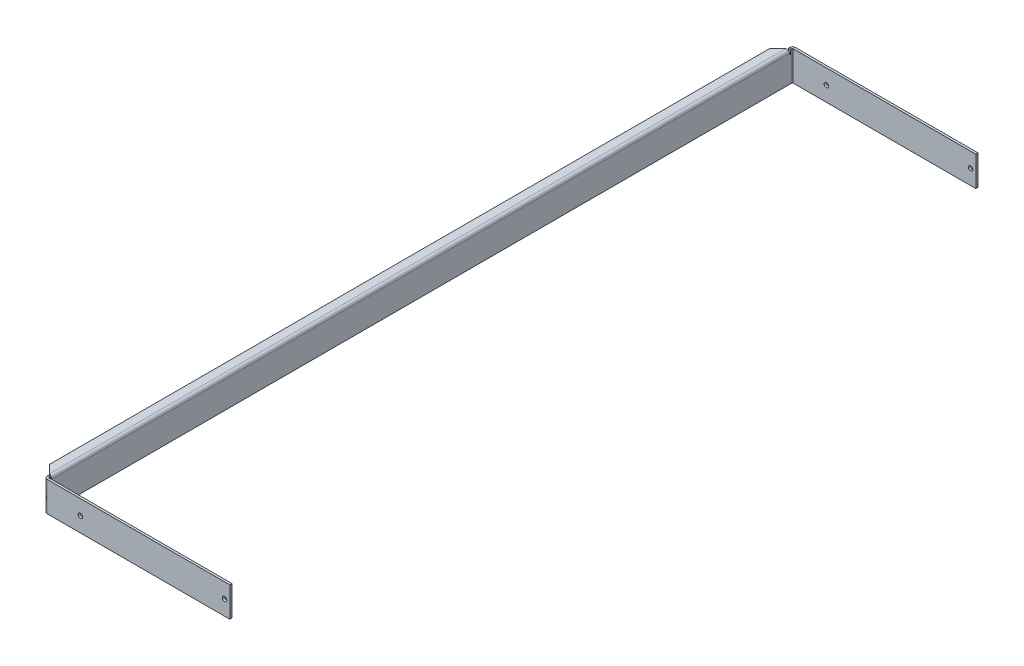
ISO-10303-21;
HEADER;
FILE_DESCRIPTION(('STEP AP214'),'2;1');
FILE_NAME('part.step','',(''),(''),'','','');
FILE_SCHEMA(('AUTOMOTIVE_DESIGN { 1 0 10303 214 1 1 1 1 }'));
ENDSEC;
DATA;
#1=APPLICATION_CONTEXT('core data for automotive mechanical design processes');
#2=APPLICATION_PROTOCOL_DEFINITION('international standard','automotive_design',2000,#1);
#3=PRODUCT_CONTEXT('',#1,'mechanical');
#4=PRODUCT('Part','Part','',(#3));
#5=PRODUCT_RELATED_PRODUCT_CATEGORY('part','',(#4));
#6=PRODUCT_DEFINITION_FORMATION('','',#4);
#7=PRODUCT_DEFINITION_CONTEXT('part definition',#1,'design');
#8=PRODUCT_DEFINITION('design','',#6,#7);
#9=PRODUCT_DEFINITION_SHAPE('','',#8);
#10=(LENGTH_UNIT() NAMED_UNIT(*) SI_UNIT(.MILLI.,.METRE.));
#11=(NAMED_UNIT(*) PLANE_ANGLE_UNIT() SI_UNIT($,.RADIAN.));
#12=(NAMED_UNIT(*) SI_UNIT($,.STERADIAN.) SOLID_ANGLE_UNIT());
#13=UNCERTAINTY_MEASURE_WITH_UNIT(LENGTH_MEASURE(1.E-05),#10,'distance_accuracy_value','');
#14=(GEOMETRIC_REPRESENTATION_CONTEXT(3) GLOBAL_UNCERTAINTY_ASSIGNED_CONTEXT((#13)) GLOBAL_UNIT_ASSIGNED_CONTEXT((#10,
#11,#12)) REPRESENTATION_CONTEXT('',''));
#15=CARTESIAN_POINT('',(0.,0.,0.));
#16=DIRECTION('',(0.,0.,1.));
#17=DIRECTION('',(1.,0.,0.));
#18=AXIS2_PLACEMENT_3D('',#15,#16,#17);
#19=CARTESIAN_POINT('',(239.,20.,-502.));
#20=DIRECTION('',(0.,0.,1.));
#21=DIRECTION('',(1.,0.,0.));
#22=AXIS2_PLACEMENT_3D('',#19,#20,#21);
#23=CYLINDRICAL_SURFACE('',#22,2.99999999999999);
#24=CARTESIAN_POINT('',(239.,20.,-502.));
#25=DIRECTION('',(0.,0.,1.));
#26=DIRECTION('',(1.,0.,0.));
#27=AXIS2_PLACEMENT_3D('',#24,#25,#26);
#28=CIRCLE('',#27,2.99999999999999);
#29=CARTESIAN_POINT('',(242.,20.,-502.));
#30=VERTEX_POINT('',#29);
#31=EDGE_CURVE('E608',#30,#30,#28,.T.);
#32=ORIENTED_EDGE('',*,*,#31,.F.);
#33=EDGE_LOOP('',(#32));
#34=FACE_BOUND('',#33,.T.);
#35=CARTESIAN_POINT('',(239.,20.,-499.));
#36=DIRECTION('',(0.,0.,-1.));
#37=DIRECTION('',(-1.,0.,0.));
#38=AXIS2_PLACEMENT_3D('',#35,#36,#37);
#39=CIRCLE('',#38,2.99999999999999);
#40=CARTESIAN_POINT('',(236.,20.,-499.));
#41=VERTEX_POINT('',#40);
#42=EDGE_CURVE('E623',#41,#41,#39,.T.);
#43=ORIENTED_EDGE('',*,*,#42,.F.);
#44=EDGE_LOOP('',(#43));
#45=FACE_BOUND('',#44,.T.);
#46=ADVANCED_FACE('F28',(#34,#45),#23,.F.);
#47=CARTESIAN_POINT('',(246.,0.,-502.));
#48=DIRECTION('',(0.,0.,1.));
#49=DIRECTION('',(1.,0.,0.));
#50=AXIS2_PLACEMENT_3D('',#47,#48,#49);
#51=PLANE('',#50);
#52=CARTESIAN_POINT('',(45.5,20.,-502.));
#53=DIRECTION('',(0.,0.,1.));
#54=DIRECTION('',(1.,0.,0.));
#55=AXIS2_PLACEMENT_3D('',#52,#53,#54);
#56=CIRCLE('',#55,3.);
#57=CARTESIAN_POINT('',(48.5,20.,-502.));
#58=VERTEX_POINT('',#57);
#59=EDGE_CURVE('E611',#58,#58,#56,.T.);
#60=ORIENTED_EDGE('',*,*,#59,.T.);
#61=EDGE_LOOP('',(#60));
#62=FACE_BOUND('',#61,.T.);
#63=ORIENTED_EDGE('',*,*,#31,.T.);
#64=EDGE_LOOP('',(#63));
#65=FACE_BOUND('',#64,.T.);
#66=DIRECTION('',(-1.,0.,0.));
#67=VECTOR('',#66,1.);
#68=CARTESIAN_POINT('',(246.,0.,-502.));
#69=LINE('',#68,#67);
#70=CARTESIAN_POINT('',(246.,0.,-502.));
#71=VERTEX_POINT('',#70);
#72=CARTESIAN_POINT('',(1.,0.,-502.));
#73=VERTEX_POINT('',#72);
#74=EDGE_CURVE('E606',#71,#73,#69,.T.);
#75=ORIENTED_EDGE('',*,*,#74,.T.);
#76=DIRECTION('',(0.,1.,0.));
#77=VECTOR('',#76,1.);
#78=CARTESIAN_POINT('',(1.,0.,-502.));
#79=LINE('',#78,#77);
#80=CARTESIAN_POINT('',(1.00000000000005,40.,-502.));
#81=VERTEX_POINT('',#80);
#82=EDGE_CURVE('E51',#73,#81,#79,.T.);
#83=ORIENTED_EDGE('',*,*,#82,.T.);
#84=DIRECTION('',(-1.,0.,0.));
#85=VECTOR('',#84,1.);
#86=CARTESIAN_POINT('',(246.,40.,-502.));
#87=LINE('',#86,#85);
#88=CARTESIAN_POINT('',(246.,40.,-502.));
#89=VERTEX_POINT('',#88);
#90=EDGE_CURVE('E594',#89,#81,#87,.T.);
#91=ORIENTED_EDGE('',*,*,#90,.F.);
#92=DIRECTION('',(0.,1.,0.));
#93=VECTOR('',#92,1.);
#94=CARTESIAN_POINT('',(246.,0.,-502.));
#95=LINE('',#94,#93);
#96=EDGE_CURVE('E587',#71,#89,#95,.T.);
#97=ORIENTED_EDGE('',*,*,#96,.F.);
#98=EDGE_LOOP('',(#75,#83,#91,#97));
#99=FACE_BOUND('',#98,.T.);
#100=ADVANCED_FACE('F567',(#62,#65,#99),#51,.F.);
#101=CARTESIAN_POINT('',(45.5,20.,-502.));
#102=DIRECTION('',(0.,0.,1.));
#103=DIRECTION('',(1.,0.,0.));
#104=AXIS2_PLACEMENT_3D('',#101,#102,#103);
#105=CYLINDRICAL_SURFACE('',#104,3.);
#106=ORIENTED_EDGE('',*,*,#59,.F.);
#107=EDGE_LOOP('',(#106));
#108=FACE_BOUND('',#107,.T.);
#109=CARTESIAN_POINT('',(45.5,20.,-499.));
#110=DIRECTION('',(0.,0.,-1.));
#111=DIRECTION('',(-1.,0.,0.));
#112=AXIS2_PLACEMENT_3D('',#109,#110,#111);
#113=CIRCLE('',#112,3.);
#114=CARTESIAN_POINT('',(42.5,20.,-499.));
#115=VERTEX_POINT('',#114);
#116=EDGE_CURVE('E626',#115,#115,#113,.T.);
#117=ORIENTED_EDGE('',*,*,#116,.F.);
#118=EDGE_LOOP('',(#117));
#119=FACE_BOUND('',#118,.T.);
#120=ADVANCED_FACE('F563',(#108,#119),#105,.F.);
#121=CARTESIAN_POINT('',(246.,40.,-499.));
#122=DIRECTION('',(0.,0.,-1.));
#123=DIRECTION('',(-1.,0.,0.));
#124=AXIS2_PLACEMENT_3D('',#121,#122,#123);
#125=PLANE('',#124);
#126=ORIENTED_EDGE('',*,*,#116,.T.);
#127=EDGE_LOOP('',(#126));
#128=FACE_BOUND('',#127,.T.);
#129=ORIENTED_EDGE('',*,*,#42,.T.);
#130=EDGE_LOOP('',(#129));
#131=FACE_BOUND('',#130,.T.);
#132=DIRECTION('',(-1.,0.,0.));
#133=VECTOR('',#132,1.);
#134=CARTESIAN_POINT('',(246.,40.,-499.));
#135=LINE('',#134,#133);
#136=CARTESIAN_POINT('',(246.,40.,-499.));
#137=VERTEX_POINT('',#136);
#138=CARTESIAN_POINT('',(1.00000000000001,40.,-499.));
#139=VERTEX_POINT('',#138);
#140=EDGE_CURVE('E598',#137,#139,#135,.T.);
#141=ORIENTED_EDGE('',*,*,#140,.T.);
#142=DIRECTION('',(0.,-1.,0.));
#143=VECTOR('',#142,1.);
#144=CARTESIAN_POINT('',(1.,0.,-499.));
#145=LINE('',#144,#143);
#146=CARTESIAN_POINT('',(1.00000000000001,0.,-499.));
#147=VERTEX_POINT('',#146);
#148=EDGE_CURVE('E240',#139,#147,#145,.T.);
#149=ORIENTED_EDGE('',*,*,#148,.T.);
#150=DIRECTION('',(-1.,0.,0.));
#151=VECTOR('',#150,1.);
#152=CARTESIAN_POINT('',(246.,0.,-499.));
#153=LINE('',#152,#151);
#154=CARTESIAN_POINT('',(246.,0.,-499.));
#155=VERTEX_POINT('',#154);
#156=EDGE_CURVE('E618',#155,#147,#153,.T.);
#157=ORIENTED_EDGE('',*,*,#156,.F.);
#158=DIRECTION('',(0.,-1.,0.));
#159=VECTOR('',#158,1.);
#160=CARTESIAN_POINT('',(246.,40.,-499.));
#161=LINE('',#160,#159);
#162=EDGE_CURVE('E43',#137,#155,#161,.T.);
#163=ORIENTED_EDGE('',*,*,#162,.F.);
#164=EDGE_LOOP('',(#141,#149,#157,#163));
#165=FACE_BOUND('',#164,.T.);
#166=ADVANCED_FACE('F560',(#128,#131,#165),#125,.F.);
#167=CARTESIAN_POINT('',(246.,0.,-2.51233650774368));
#168=DIRECTION('',(0.,-1.,0.));
#169=DIRECTION('',(0.,0.,1.));
#170=AXIS2_PLACEMENT_3D('',#167,#168,#169);
#171=PLANE('',#170);
#172=ORIENTED_EDGE('',*,*,#74,.F.);
#173=DIRECTION('',(0.,0.,-1.));
#174=VECTOR('',#173,1.);
#175=CARTESIAN_POINT('',(246.,0.,-2.51233650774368));
#176=LINE('',#175,#174);
#177=EDGE_CURVE('E36',#155,#71,#176,.T.);
#178=ORIENTED_EDGE('',*,*,#177,.F.);
#179=ORIENTED_EDGE('',*,*,#156,.T.);
#180=DIRECTION('',(0.,0.,-1.));
#181=VECTOR('',#180,1.);
#182=CARTESIAN_POINT('',(1.,0.,-2.51233650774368));
#183=LINE('',#182,#181);
#184=EDGE_CURVE('E11',#147,#73,#183,.T.);
#185=ORIENTED_EDGE('',*,*,#184,.T.);
#186=EDGE_LOOP('',(#172,#178,#179,#185));
#187=FACE_BOUND('',#186,.T.);
#188=ADVANCED_FACE('F30',(#187),#171,.T.);
#189=CARTESIAN_POINT('',(246.,40.,-2.51233650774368));
#190=DIRECTION('',(1.,0.,0.));
#191=DIRECTION('',(0.,0.,-1.));
#192=AXIS2_PLACEMENT_3D('',#189,#190,#191);
#193=PLANE('',#192);
#194=ORIENTED_EDGE('',*,*,#96,.T.);
#195=DIRECTION('',(0.,0.,-1.));
#196=VECTOR('',#195,1.);
#197=CARTESIAN_POINT('',(246.,40.,-2.51233650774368));
#198=LINE('',#197,#196);
#199=EDGE_CURVE('E589',#137,#89,#198,.T.);
#200=ORIENTED_EDGE('',*,*,#199,.F.);
#201=ORIENTED_EDGE('',*,*,#162,.T.);
#202=ORIENTED_EDGE('',*,*,#177,.T.);
#203=EDGE_LOOP('',(#194,#200,#201,#202));
#204=FACE_BOUND('',#203,.T.);
#205=ADVANCED_FACE('F576',(#204),#193,.T.);
#206=CARTESIAN_POINT('',(246.,40.,-2.51233650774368));
#207=DIRECTION('',(0.,-1.,0.));
#208=DIRECTION('',(0.,0.,1.));
#209=AXIS2_PLACEMENT_3D('',#206,#207,#208);
#210=PLANE('',#209);
#211=ORIENTED_EDGE('',*,*,#199,.T.);
#212=ORIENTED_EDGE('',*,*,#90,.T.);
#213=DIRECTION('',(0.,0.,-1.));
#214=VECTOR('',#213,1.);
#215=CARTESIAN_POINT('',(1.,40.,-2.51233650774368));
#216=LINE('',#215,#214);
#217=EDGE_CURVE('E599',#139,#81,#216,.T.);
#218=ORIENTED_EDGE('',*,*,#217,.F.);
#219=ORIENTED_EDGE('',*,*,#140,.F.);
#220=EDGE_LOOP('',(#211,#212,#218,#219));
#221=FACE_BOUND('',#220,.T.);
#222=ADVANCED_FACE('F538',(#221),#210,.F.);
#223=CARTESIAN_POINT('',(239.,20.,-502.));
#224=DIRECTION('',(0.,0.,1.));
#225=DIRECTION('',(1.,0.,0.));
#226=AXIS2_PLACEMENT_3D('',#223,#224,#225);
#227=CYLINDRICAL_SURFACE('',#226,2.99999999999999);
#228=CARTESIAN_POINT('',(239.,20.,499.));
#229=DIRECTION('',(0.,0.,-1.));
#230=DIRECTION('',(-1.,0.,0.));
#231=AXIS2_PLACEMENT_3D('',#228,#229,#230);
#232=CIRCLE('',#231,2.99999999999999);
#233=CARTESIAN_POINT('',(236.,20.,499.));
#234=VERTEX_POINT('',#233);
#235=EDGE_CURVE('E673',#234,#234,#232,.T.);
#236=ORIENTED_EDGE('',*,*,#235,.T.);
#237=EDGE_LOOP('',(#236));
#238=FACE_BOUND('',#237,.T.);
#239=CARTESIAN_POINT('',(239.,20.,502.));
#240=DIRECTION('',(0.,0.,1.));
#241=DIRECTION('',(1.,0.,0.));
#242=AXIS2_PLACEMENT_3D('',#239,#240,#241);
#243=CIRCLE('',#242,2.99999999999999);
#244=CARTESIAN_POINT('',(242.,20.,502.));
#245=VERTEX_POINT('',#244);
#246=EDGE_CURVE('E654',#245,#245,#243,.T.);
#247=ORIENTED_EDGE('',*,*,#246,.T.);
#248=EDGE_LOOP('',(#247));
#249=FACE_BOUND('',#248,.T.);
#250=ADVANCED_FACE('F545',(#238,#249),#227,.F.);
#251=CARTESIAN_POINT('',(246.,0.,502.));
#252=DIRECTION('',(0.,0.,1.));
#253=DIRECTION('',(1.,0.,0.));
#254=AXIS2_PLACEMENT_3D('',#251,#252,#253);
#255=PLANE('',#254);
#256=DIRECTION('',(0.,1.,0.));
#257=VECTOR('',#256,1.);
#258=CARTESIAN_POINT('',(1.,40.,502.));
#259=LINE('',#258,#257);
#260=CARTESIAN_POINT('',(1.00000000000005,0.,502.));
#261=VERTEX_POINT('',#260);
#262=CARTESIAN_POINT('',(1.,40.,502.));
#263=VERTEX_POINT('',#262);
#264=EDGE_CURVE('E639',#261,#263,#259,.T.);
#265=ORIENTED_EDGE('',*,*,#264,.F.);
#266=DIRECTION('',(-1.,0.,0.));
#267=VECTOR('',#266,1.);
#268=CARTESIAN_POINT('',(246.,0.,502.));
#269=LINE('',#268,#267);
#270=CARTESIAN_POINT('',(246.,0.,502.));
#271=VERTEX_POINT('',#270);
#272=EDGE_CURVE('E648',#271,#261,#269,.T.);
#273=ORIENTED_EDGE('',*,*,#272,.F.);
#274=DIRECTION('',(0.,1.,0.));
#275=VECTOR('',#274,1.);
#276=CARTESIAN_POINT('',(246.,0.,502.));
#277=LINE('',#276,#275);
#278=CARTESIAN_POINT('',(246.,40.,502.));
#279=VERTEX_POINT('',#278);
#280=EDGE_CURVE('E645',#271,#279,#277,.T.);
#281=ORIENTED_EDGE('',*,*,#280,.T.);
#282=DIRECTION('',(-1.,0.,0.));
#283=VECTOR('',#282,1.);
#284=CARTESIAN_POINT('',(246.,40.,502.));
#285=LINE('',#284,#283);
#286=EDGE_CURVE('E651',#279,#263,#285,.T.);
#287=ORIENTED_EDGE('',*,*,#286,.T.);
#288=EDGE_LOOP('',(#265,#273,#281,#287));
#289=FACE_BOUND('',#288,.T.);
#290=CARTESIAN_POINT('',(45.5,20.,502.));
#291=DIRECTION('',(0.,0.,1.));
#292=DIRECTION('',(1.,0.,0.));
#293=AXIS2_PLACEMENT_3D('',#290,#291,#292);
#294=CIRCLE('',#293,3.);
#295=CARTESIAN_POINT('',(48.5,20.,502.));
#296=VERTEX_POINT('',#295);
#297=EDGE_CURVE('E657',#296,#296,#294,.T.);
#298=ORIENTED_EDGE('',*,*,#297,.F.);
#299=EDGE_LOOP('',(#298));
#300=FACE_BOUND('',#299,.T.);
#301=ORIENTED_EDGE('',*,*,#246,.F.);
#302=EDGE_LOOP('',(#301));
#303=FACE_BOUND('',#302,.T.);
#304=ADVANCED_FACE('F541',(#289,#300,#303),#255,.T.);
#305=CARTESIAN_POINT('',(45.5,20.,-502.));
#306=DIRECTION('',(0.,0.,1.));
#307=DIRECTION('',(1.,0.,0.));
#308=AXIS2_PLACEMENT_3D('',#305,#306,#307);
#309=CYLINDRICAL_SURFACE('',#308,3.);
#310=CARTESIAN_POINT('',(45.5,20.,499.));
#311=DIRECTION('',(0.,0.,-1.));
#312=DIRECTION('',(-1.,0.,0.));
#313=AXIS2_PLACEMENT_3D('',#310,#311,#312);
#314=CIRCLE('',#313,3.);
#315=CARTESIAN_POINT('',(42.5,20.,499.));
#316=VERTEX_POINT('',#315);
#317=EDGE_CURVE('E676',#316,#316,#314,.T.);
#318=ORIENTED_EDGE('',*,*,#317,.T.);
#319=EDGE_LOOP('',(#318));
#320=FACE_BOUND('',#319,.T.);
#321=ORIENTED_EDGE('',*,*,#297,.T.);
#322=EDGE_LOOP('',(#321));
#323=FACE_BOUND('',#322,.T.);
#324=ADVANCED_FACE('F536',(#320,#323),#309,.F.);
#325=CARTESIAN_POINT('',(246.,40.,499.));
#326=DIRECTION('',(0.,0.,-1.));
#327=DIRECTION('',(-1.,0.,0.));
#328=AXIS2_PLACEMENT_3D('',#325,#326,#327);
#329=PLANE('',#328);
#330=DIRECTION('',(0.,-1.,0.));
#331=VECTOR('',#330,1.);
#332=CARTESIAN_POINT('',(1.,40.,499.));
#333=LINE('',#332,#331);
#334=CARTESIAN_POINT('',(1.00000000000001,40.,499.));
#335=VERTEX_POINT('',#334);
#336=CARTESIAN_POINT('',(1.00000000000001,0.,499.));
#337=VERTEX_POINT('',#336);
#338=EDGE_CURVE('E642',#335,#337,#333,.T.);
#339=ORIENTED_EDGE('',*,*,#338,.F.);
#340=DIRECTION('',(-1.,0.,0.));
#341=VECTOR('',#340,1.);
#342=CARTESIAN_POINT('',(246.,40.,499.));
#343=LINE('',#342,#341);
#344=CARTESIAN_POINT('',(246.,40.,499.));
#345=VERTEX_POINT('',#344);
#346=EDGE_CURVE('E663',#345,#335,#343,.T.);
#347=ORIENTED_EDGE('',*,*,#346,.F.);
#348=DIRECTION('',(0.,-1.,0.));
#349=VECTOR('',#348,1.);
#350=CARTESIAN_POINT('',(246.,40.,499.));
#351=LINE('',#350,#349);
#352=CARTESIAN_POINT('',(246.,0.,499.));
#353=VERTEX_POINT('',#352);
#354=EDGE_CURVE('E660',#345,#353,#351,.T.);
#355=ORIENTED_EDGE('',*,*,#354,.T.);
#356=DIRECTION('',(-1.,0.,0.));
#357=VECTOR('',#356,1.);
#358=CARTESIAN_POINT('',(246.,0.,499.));
#359=LINE('',#358,#357);
#360=EDGE_CURVE('E668',#353,#337,#359,.T.);
#361=ORIENTED_EDGE('',*,*,#360,.T.);
#362=EDGE_LOOP('',(#339,#347,#355,#361));
#363=FACE_BOUND('',#362,.T.);
#364=ORIENTED_EDGE('',*,*,#317,.F.);
#365=EDGE_LOOP('',(#364));
#366=FACE_BOUND('',#365,.T.);
#367=ORIENTED_EDGE('',*,*,#235,.F.);
#368=EDGE_LOOP('',(#367));
#369=FACE_BOUND('',#368,.T.);
#370=ADVANCED_FACE('F532',(#363,#366,#369),#329,.T.);
#371=CARTESIAN_POINT('',(246.,40.,2.51233650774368));
#372=DIRECTION('',(0.,1.,0.));
#373=DIRECTION('',(0.,0.,1.));
#374=AXIS2_PLACEMENT_3D('',#371,#372,#373);
#375=PLANE('',#374);
#376=DIRECTION('',(0.,0.,1.));
#377=VECTOR('',#376,1.);
#378=CARTESIAN_POINT('',(1.,40.,2.51233650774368));
#379=LINE('',#378,#377);
#380=EDGE_CURVE('E629',#335,#263,#379,.T.);
#381=ORIENTED_EDGE('',*,*,#380,.T.);
#382=ORIENTED_EDGE('',*,*,#286,.F.);
#383=DIRECTION('',(0.,0.,1.));
#384=VECTOR('',#383,1.);
#385=CARTESIAN_POINT('',(246.,40.,2.51233650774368));
#386=LINE('',#385,#384);
#387=EDGE_CURVE('E632',#345,#279,#386,.T.);
#388=ORIENTED_EDGE('',*,*,#387,.F.);
#389=ORIENTED_EDGE('',*,*,#346,.T.);
#390=EDGE_LOOP('',(#381,#382,#388,#389));
#391=FACE_BOUND('',#390,.T.);
#392=ADVANCED_FACE('F535',(#391),#375,.T.);
#393=CARTESIAN_POINT('',(246.,40.,2.51233650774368));
#394=DIRECTION('',(-1.,0.,0.));
#395=DIRECTION('',(0.,0.,1.));
#396=AXIS2_PLACEMENT_3D('',#393,#394,#395);
#397=PLANE('',#396);
#398=ORIENTED_EDGE('',*,*,#280,.F.);
#399=DIRECTION('',(0.,0.,1.));
#400=VECTOR('',#399,1.);
#401=CARTESIAN_POINT('',(246.,0.,2.51233650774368));
#402=LINE('',#401,#400);
#403=EDGE_CURVE('E635',#353,#271,#402,.T.);
#404=ORIENTED_EDGE('',*,*,#403,.F.);
#405=ORIENTED_EDGE('',*,*,#354,.F.);
#406=ORIENTED_EDGE('',*,*,#387,.T.);
#407=EDGE_LOOP('',(#398,#404,#405,#406));
#408=FACE_BOUND('',#407,.T.);
#409=ADVANCED_FACE('F552',(#408),#397,.F.);
#410=CARTESIAN_POINT('',(246.,0.,2.51233650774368));
#411=DIRECTION('',(0.,1.,0.));
#412=DIRECTION('',(0.,0.,1.));
#413=AXIS2_PLACEMENT_3D('',#410,#411,#412);
#414=PLANE('',#413);
#415=ORIENTED_EDGE('',*,*,#272,.T.);
#416=DIRECTION('',(0.,0.,1.));
#417=VECTOR('',#416,1.);
#418=CARTESIAN_POINT('',(1.,0.,2.51233650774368));
#419=LINE('',#418,#417);
#420=EDGE_CURVE('E637',#337,#261,#419,.T.);
#421=ORIENTED_EDGE('',*,*,#420,.F.);
#422=ORIENTED_EDGE('',*,*,#360,.F.);
#423=ORIENTED_EDGE('',*,*,#403,.T.);
#424=EDGE_LOOP('',(#415,#421,#422,#423));
#425=FACE_BOUND('',#424,.T.);
#426=ADVANCED_FACE('F530',(#425),#414,.F.);
#427=CARTESIAN_POINT('',(-6.9999999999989,-1936.12246584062,491.));
#428=DIRECTION('',(0.707106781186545,0.,-0.70710678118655));
#429=DIRECTION('',(-0.70710678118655,0.,-0.707106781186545));
#430=AXIS2_PLACEMENT_3D('',#427,#428,#429);
#431=PLANE('',#430);
#432=CARTESIAN_POINT('',(-4.00000000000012,39.9999999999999,494.));
#433=CARTESIAN_POINT('',(-4.00000000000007,36.9999999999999,494.));
#434=B_SPLINE_CURVE_WITH_KNOTS('',1,(#432,#433),.UNSPECIFIED.,.F.,.F.,(2,2),(0.,1.),.UNSPECIFIED.);
#435=CARTESIAN_POINT('',(-4.00000000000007,36.9999999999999,494.));
#436=VERTEX_POINT('',#435);
#437=CARTESIAN_POINT('',(-4.00000000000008,39.9999999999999,494.));
#438=VERTEX_POINT('',#437);
#439=EDGE_CURVE('E500',#436,#438,#434,.F.);
#440=ORIENTED_EDGE('',*,*,#439,.T.);
#441=DIRECTION('',(-0.70710678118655,0.,-0.707106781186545));
#442=VECTOR('',#441,1.);
#443=CARTESIAN_POINT('',(-3.,39.9999999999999,495.));
#444=LINE('',#443,#442);
#445=CARTESIAN_POINT('',(-15.,39.9999999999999,483.));
#446=VERTEX_POINT('',#445);
#447=EDGE_CURVE('E488',#438,#446,#444,.T.);
#448=ORIENTED_EDGE('',*,*,#447,.T.);
#449=DIRECTION('',(0.,1.,0.));
#450=VECTOR('',#449,1.);
#451=CARTESIAN_POINT('',(-14.9999999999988,-1936.12246584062,483.));
#452=LINE('',#451,#450);
#453=CARTESIAN_POINT('',(-15.,36.9999999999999,483.));
#454=VERTEX_POINT('',#453);
#455=EDGE_CURVE('E496',#454,#446,#452,.T.);
#456=ORIENTED_EDGE('',*,*,#455,.F.);
#457=DIRECTION('',(-0.70710678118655,0.,-0.707106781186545));
#458=VECTOR('',#457,1.);
#459=CARTESIAN_POINT('',(-7.00000000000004,36.9999999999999,491.));
#460=LINE('',#459,#458);
#461=EDGE_CURVE('E930',#436,#454,#460,.T.);
#462=ORIENTED_EDGE('',*,*,#461,.F.);
#463=EDGE_LOOP('',(#440,#448,#456,#462));
#464=FACE_BOUND('',#463,.T.);
#465=ADVANCED_FACE('F519',(#464),#431,.F.);
#466=CARTESIAN_POINT('',(-14.9999999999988,-1936.12246584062,499.));
#467=DIRECTION('',(1.,0.,0.));
#468=DIRECTION('',(0.,1.,0.));
#469=AXIS2_PLACEMENT_3D('',#466,#467,#468);
#470=PLANE('',#469);
#471=ORIENTED_EDGE('',*,*,#455,.T.);
#472=DIRECTION('',(0.,0.,-1.));
#473=VECTOR('',#472,1.);
#474=CARTESIAN_POINT('',(-15.,39.9999999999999,499.));
#475=LINE('',#474,#473);
#476=CARTESIAN_POINT('',(-15.0000000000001,40.,-483.));
#477=VERTEX_POINT('',#476);
#478=EDGE_CURVE('E485',#446,#477,#475,.T.);
#479=ORIENTED_EDGE('',*,*,#478,.T.);
#480=DIRECTION('',(0.,1.,0.));
#481=VECTOR('',#480,1.);
#482=CARTESIAN_POINT('',(-14.999999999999,-1936.12246584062,-483.));
#483=LINE('',#482,#481);
#484=CARTESIAN_POINT('',(-15.0000000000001,37.,-483.));
#485=VERTEX_POINT('',#484);
#486=EDGE_CURVE('E493',#485,#477,#483,.T.);
#487=ORIENTED_EDGE('',*,*,#486,.F.);
#488=DIRECTION('',(0.,0.,-1.));
#489=VECTOR('',#488,1.);
#490=CARTESIAN_POINT('',(-15.,36.9999999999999,499.));
#491=LINE('',#490,#489);
#492=EDGE_CURVE('E489',#454,#485,#491,.T.);
#493=ORIENTED_EDGE('',*,*,#492,.F.);
#494=EDGE_LOOP('',(#471,#479,#487,#493));
#495=FACE_BOUND('',#494,.T.);
#496=ADVANCED_FACE('F529',(#495),#470,.F.);
#497=CARTESIAN_POINT('',(-505.999999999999,-1936.12246584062,7.99999999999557));
#498=DIRECTION('',(0.707106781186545,0.,0.70710678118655));
#499=DIRECTION('',(0.70710678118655,0.,-0.707106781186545));
#500=AXIS2_PLACEMENT_3D('',#497,#498,#499);
#501=PLANE('',#500);
#502=ORIENTED_EDGE('',*,*,#486,.T.);
#503=DIRECTION('',(0.70710678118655,0.,-0.707106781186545));
#504=VECTOR('',#503,1.);
#505=CARTESIAN_POINT('',(-3.00000000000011,40.,-495.));
#506=LINE('',#505,#504);
#507=CARTESIAN_POINT('',(-4.00000000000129,40.,-494.));
#508=VERTEX_POINT('',#507);
#509=EDGE_CURVE('E484',#477,#508,#506,.T.);
#510=ORIENTED_EDGE('',*,*,#509,.T.);
#511=CARTESIAN_POINT('',(-4.0000000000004,37.,-494.));
#512=CARTESIAN_POINT('',(-4.00000000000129,40.,-494.));
#513=B_SPLINE_CURVE_WITH_KNOTS('',1,(#511,#512),.UNSPECIFIED.,.F.,.F.,(2,2),(0.,1.),.UNSPECIFIED.);
#514=CARTESIAN_POINT('',(-4.0000000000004,37.,-494.));
#515=VERTEX_POINT('',#514);
#516=EDGE_CURVE('E497',#515,#508,#513,.T.);
#517=ORIENTED_EDGE('',*,*,#516,.F.);
#518=DIRECTION('',(0.70710678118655,0.,-0.707106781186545));
#519=VECTOR('',#518,1.);
#520=CARTESIAN_POINT('',(-506.,36.9999999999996,7.99999999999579));
#521=LINE('',#520,#519);
#522=EDGE_CURVE('E491',#485,#515,#521,.T.);
#523=ORIENTED_EDGE('',*,*,#522,.F.);
#524=EDGE_LOOP('',(#502,#510,#517,#523));
#525=FACE_BOUND('',#524,.T.);
#526=ADVANCED_FACE('F687',(#525),#501,.F.);
#527=CARTESIAN_POINT('',(-15.,36.9999999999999,499.));
#528=DIRECTION('',(0.,1.,0.));
#529=DIRECTION('',(-1.,0.,0.));
#530=AXIS2_PLACEMENT_3D('',#527,#528,#529);
#531=PLANE('',#530);
#532=ORIENTED_EDGE('',*,*,#522,.T.);
#533=DIRECTION('',(0.,0.,1.));
#534=VECTOR('',#533,1.);
#535=CARTESIAN_POINT('',(-4.00000000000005,36.9999999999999,494.));
#536=LINE('',#535,#534);
#537=EDGE_CURVE('E517',#515,#436,#536,.T.);
#538=ORIENTED_EDGE('',*,*,#537,.T.);
#539=ORIENTED_EDGE('',*,*,#461,.T.);
#540=ORIENTED_EDGE('',*,*,#492,.T.);
#541=EDGE_LOOP('',(#532,#538,#539,#540));
#542=FACE_BOUND('',#541,.T.);
#543=ADVANCED_FACE('F696',(#542),#531,.F.);
#544=CARTESIAN_POINT('',(0.,39.9999999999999,499.));
#545=DIRECTION('',(0.,-1.,0.));
#546=DIRECTION('',(1.,0.,0.));
#547=AXIS2_PLACEMENT_3D('',#544,#545,#546);
#548=PLANE('',#547);
#549=ORIENTED_EDGE('',*,*,#447,.F.);
#550=DIRECTION('',(0.,0.,-1.));
#551=VECTOR('',#550,1.);
#552=CARTESIAN_POINT('',(-4.00000000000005,40.,494.));
#553=LINE('',#552,#551);
#554=EDGE_CURVE('E492',#438,#508,#553,.T.);
#555=ORIENTED_EDGE('',*,*,#554,.T.);
#556=ORIENTED_EDGE('',*,*,#509,.F.);
#557=ORIENTED_EDGE('',*,*,#478,.F.);
#558=EDGE_LOOP('',(#549,#555,#556,#557));
#559=FACE_BOUND('',#558,.T.);
#560=ADVANCED_FACE('F700',(#559),#548,.F.);
#561=CARTESIAN_POINT('',(-1993.6057784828,2.8086636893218E-13,499.));
#562=DIRECTION('',(0.,-1.,0.));
#563=DIRECTION('',(1.,0.,0.));
#564=AXIS2_PLACEMENT_3D('',#561,#562,#563);
#565=PLANE('',#564);
#566=DIRECTION('',(0.,0.,-1.));
#567=VECTOR('',#566,1.);
#568=CARTESIAN_POINT('',(0.,0.,499.));
#569=LINE('',#568,#567);
#570=CARTESIAN_POINT('',(0.,0.,498.));
#571=VERTEX_POINT('',#570);
#572=CARTESIAN_POINT('',(0.,0.,-497.999999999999));
#573=VERTEX_POINT('',#572);
#574=EDGE_CURVE('E209',#571,#573,#569,.T.);
#575=ORIENTED_EDGE('',*,*,#574,.F.);
#576=DIRECTION('',(1.,0.,0.));
#577=VECTOR('',#576,1.);
#578=CARTESIAN_POINT('',(-1993.6057784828,2.8086636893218E-13,498.));
#579=LINE('',#578,#577);
#580=CARTESIAN_POINT('',(-3.,0.,498.));
#581=VERTEX_POINT('',#580);
#582=EDGE_CURVE('E479',#581,#571,#579,.T.);
#583=ORIENTED_EDGE('',*,*,#582,.F.);
#584=DIRECTION('',(0.,0.,-1.));
#585=VECTOR('',#584,1.);
#586=CARTESIAN_POINT('',(-3.,0.,499.));
#587=LINE('',#586,#585);
#588=CARTESIAN_POINT('',(-3.,0.,-497.999999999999));
#589=VERTEX_POINT('',#588);
#590=EDGE_CURVE('E440',#581,#589,#587,.T.);
#591=ORIENTED_EDGE('',*,*,#590,.T.);
#592=DIRECTION('',(1.,0.,0.));
#593=VECTOR('',#592,1.);
#594=CARTESIAN_POINT('',(-1993.6057784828,2.8086636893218E-13,-498.));
#595=LINE('',#594,#593);
#596=EDGE_CURVE('E482',#589,#573,#595,.T.);
#597=ORIENTED_EDGE('',*,*,#596,.T.);
#598=EDGE_LOOP('',(#575,#583,#591,#597));
#599=FACE_BOUND('',#598,.T.);
#600=ADVANCED_FACE('F704',(#599),#565,.T.);
#601=CARTESIAN_POINT('',(-1993.6057784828,40.0000000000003,499.));
#602=DIRECTION('',(0.,-1.,0.));
#603=DIRECTION('',(1.,0.,0.));
#604=AXIS2_PLACEMENT_3D('',#601,#602,#603);
#605=PLANE('',#604);
#606=DIRECTION('',(1.,0.,0.));
#607=VECTOR('',#606,1.);
#608=CARTESIAN_POINT('',(-1993.6057784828,40.0000000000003,498.));
#609=LINE('',#608,#607);
#610=CARTESIAN_POINT('',(-3.,40.,498.));
#611=VERTEX_POINT('',#610);
#612=CARTESIAN_POINT('',(0.,40.,498.));
#613=VERTEX_POINT('',#612);
#614=EDGE_CURVE('E476',#611,#613,#609,.T.);
#615=ORIENTED_EDGE('',*,*,#614,.T.);
#616=DIRECTION('',(0.,0.,-1.));
#617=VECTOR('',#616,1.);
#618=CARTESIAN_POINT('',(0.,40.,499.));
#619=LINE('',#618,#617);
#620=CARTESIAN_POINT('',(0.,40.,496.5));
#621=VERTEX_POINT('',#620);
#622=EDGE_CURVE('E409',#613,#621,#619,.T.);
#623=ORIENTED_EDGE('',*,*,#622,.T.);
#624=DIRECTION('',(1.,0.,0.));
#625=VECTOR('',#624,1.);
#626=CARTESIAN_POINT('',(-1993.6057784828,40.0000000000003,496.5));
#627=LINE('',#626,#625);
#628=CARTESIAN_POINT('',(-3.,40.,496.5));
#629=VERTEX_POINT('',#628);
#630=EDGE_CURVE('E473',#629,#621,#627,.T.);
#631=ORIENTED_EDGE('',*,*,#630,.F.);
#632=DIRECTION('',(0.,0.,-1.));
#633=VECTOR('',#632,1.);
#634=CARTESIAN_POINT('',(-3.,40.,499.));
#635=LINE('',#634,#633);
#636=EDGE_CURVE('E443',#611,#629,#635,.T.);
#637=ORIENTED_EDGE('',*,*,#636,.F.);
#638=EDGE_LOOP('',(#615,#623,#631,#637));
#639=FACE_BOUND('',#638,.T.);
#640=ADVANCED_FACE('F708',(#639),#605,.F.);
#641=CARTESIAN_POINT('',(-1993.6057784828,37.0000000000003,496.5));
#642=DIRECTION('',(0.,0.,-1.));
#643=DIRECTION('',(-1.,0.,0.));
#644=AXIS2_PLACEMENT_3D('',#641,#642,#643);
#645=PLANE('',#644);
#646=DIRECTION('',(0.,-1.,0.));
#647=VECTOR('',#646,1.);
#648=CARTESIAN_POINT('',(0.,0.,496.5));
#649=LINE('',#648,#647);
#650=CARTESIAN_POINT('',(0.,34.5,496.5));
#651=VERTEX_POINT('',#650);
#652=EDGE_CURVE('E856',#621,#651,#649,.T.);
#653=ORIENTED_EDGE('',*,*,#652,.T.);
#654=DIRECTION('',(1.,0.,0.));
#655=VECTOR('',#654,1.);
#656=CARTESIAN_POINT('',(-1993.6057784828,34.5000000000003,496.5));
#657=LINE('',#656,#655);
#658=CARTESIAN_POINT('',(-3.,34.5,496.5));
#659=VERTEX_POINT('',#658);
#660=EDGE_CURVE('E470',#659,#651,#657,.T.);
#661=ORIENTED_EDGE('',*,*,#660,.F.);
#662=DIRECTION('',(0.,1.,0.));
#663=VECTOR('',#662,1.);
#664=CARTESIAN_POINT('',(-3.,37.,496.5));
#665=LINE('',#664,#663);
#666=EDGE_CURVE('E446',#659,#629,#665,.T.);
#667=ORIENTED_EDGE('',*,*,#666,.T.);
#668=ORIENTED_EDGE('',*,*,#630,.T.);
#669=EDGE_LOOP('',(#653,#661,#667,#668));
#670=FACE_BOUND('',#669,.T.);
#671=ADVANCED_FACE('F712',(#670),#645,.T.);
#672=CARTESIAN_POINT('',(-1993.6057784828,34.5000000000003,499.));
#673=DIRECTION('',(0.,1.,0.));
#674=DIRECTION('',(-1.,0.,0.));
#675=AXIS2_PLACEMENT_3D('',#672,#673,#674);
#676=PLANE('',#675);
#677=DIRECTION('',(0.,0.,-1.));
#678=VECTOR('',#677,1.);
#679=CARTESIAN_POINT('',(0.,34.5,499.));
#680=LINE('',#679,#678);
#681=CARTESIAN_POINT('',(0.,34.5,495.));
#682=VERTEX_POINT('',#681);
#683=EDGE_CURVE('E869',#651,#682,#680,.T.);
#684=ORIENTED_EDGE('',*,*,#683,.T.);
#685=DIRECTION('',(1.,0.,0.));
#686=VECTOR('',#685,1.);
#687=CARTESIAN_POINT('',(-1993.6057784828,34.5000000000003,495.));
#688=LINE('',#687,#686);
#689=CARTESIAN_POINT('',(-3.,34.5,495.));
#690=VERTEX_POINT('',#689);
#691=EDGE_CURVE('E467',#690,#682,#688,.T.);
#692=ORIENTED_EDGE('',*,*,#691,.F.);
#693=DIRECTION('',(0.,0.,1.));
#694=VECTOR('',#693,1.);
#695=CARTESIAN_POINT('',(-3.,34.5,499.));
#696=LINE('',#695,#694);
#697=EDGE_CURVE('E861',#690,#659,#696,.T.);
#698=ORIENTED_EDGE('',*,*,#697,.T.);
#699=ORIENTED_EDGE('',*,*,#660,.T.);
#700=EDGE_LOOP('',(#684,#692,#698,#699));
#701=FACE_BOUND('',#700,.T.);
#702=ADVANCED_FACE('F716',(#701),#676,.T.);
#703=CARTESIAN_POINT('',(-1993.6057784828,37.0000000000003,495.));
#704=DIRECTION('',(0.,0.,1.));
#705=DIRECTION('',(1.,0.,0.));
#706=AXIS2_PLACEMENT_3D('',#703,#704,#705);
#707=PLANE('',#706);
#708=DIRECTION('',(0.,1.,0.));
#709=VECTOR('',#708,1.);
#710=CARTESIAN_POINT('',(0.,0.,495.));
#711=LINE('',#710,#709);
#712=CARTESIAN_POINT('',(0.,36.,495.));
#713=VERTEX_POINT('',#712);
#714=EDGE_CURVE('E403',#682,#713,#711,.T.);
#715=ORIENTED_EDGE('',*,*,#714,.T.);
#716=DIRECTION('',(1.,0.,0.));
#717=VECTOR('',#716,1.);
#718=CARTESIAN_POINT('',(-1993.6057784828,36.0000000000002,495.));
#719=LINE('',#718,#717);
#720=CARTESIAN_POINT('',(-3.00000000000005,36.,495.));
#721=VERTEX_POINT('',#720);
#722=EDGE_CURVE('E465',#721,#713,#719,.T.);
#723=ORIENTED_EDGE('',*,*,#722,.F.);
#724=DIRECTION('',(0.,-1.,0.));
#725=VECTOR('',#724,1.);
#726=CARTESIAN_POINT('',(-3.,37.,495.));
#727=LINE('',#726,#725);
#728=EDGE_CURVE('E451',#721,#690,#727,.T.);
#729=ORIENTED_EDGE('',*,*,#728,.T.);
#730=ORIENTED_EDGE('',*,*,#691,.T.);
#731=EDGE_LOOP('',(#715,#723,#729,#730));
#732=FACE_BOUND('',#731,.T.);
#733=ADVANCED_FACE('F720',(#732),#707,.T.);
#734=CARTESIAN_POINT('',(-1993.6057784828,37.0000000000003,-495.));
#735=DIRECTION('',(0.,0.,-1.));
#736=DIRECTION('',(-1.,0.,0.));
#737=AXIS2_PLACEMENT_3D('',#734,#735,#736);
#738=PLANE('',#737);
#739=DIRECTION('',(0.,-1.,0.));
#740=VECTOR('',#739,1.);
#741=CARTESIAN_POINT('',(0.,0.,-495.));
#742=LINE('',#741,#740);
#743=CARTESIAN_POINT('',(0.,36.,-495.));
#744=VERTEX_POINT('',#743);
#745=CARTESIAN_POINT('',(0.,34.5,-495.));
#746=VERTEX_POINT('',#745);
#747=EDGE_CURVE('E395',#744,#746,#742,.T.);
#748=ORIENTED_EDGE('',*,*,#747,.T.);
#749=DIRECTION('',(1.,0.,0.));
#750=VECTOR('',#749,1.);
#751=CARTESIAN_POINT('',(-1993.6057784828,34.5000000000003,-495.));
#752=LINE('',#751,#750);
#753=CARTESIAN_POINT('',(-3.,34.5,-495.));
#754=VERTEX_POINT('',#753);
#755=EDGE_CURVE('E461',#754,#746,#752,.T.);
#756=ORIENTED_EDGE('',*,*,#755,.F.);
#757=DIRECTION('',(0.,1.,0.));
#758=VECTOR('',#757,1.);
#759=CARTESIAN_POINT('',(-3.,37.,-495.));
#760=LINE('',#759,#758);
#761=CARTESIAN_POINT('',(-3.00000000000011,36.0000000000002,-495.));
#762=VERTEX_POINT('',#761);
#763=EDGE_CURVE('E215',#754,#762,#760,.T.);
#764=ORIENTED_EDGE('',*,*,#763,.T.);
#765=DIRECTION('',(1.,0.,0.));
#766=VECTOR('',#765,1.);
#767=CARTESIAN_POINT('',(-1993.6057784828,36.0000000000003,-495.));
#768=LINE('',#767,#766);
#769=EDGE_CURVE('E463',#762,#744,#768,.T.);
#770=ORIENTED_EDGE('',*,*,#769,.T.);
#771=EDGE_LOOP('',(#748,#756,#764,#770));
#772=FACE_BOUND('',#771,.T.);
#773=ADVANCED_FACE('F724',(#772),#738,.T.);
#774=CARTESIAN_POINT('',(-1993.6057784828,34.5000000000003,499.));
#775=DIRECTION('',(0.,1.,0.));
#776=DIRECTION('',(-1.,0.,0.));
#777=AXIS2_PLACEMENT_3D('',#774,#775,#776);
#778=PLANE('',#777);
#779=DIRECTION('',(0.,0.,-1.));
#780=VECTOR('',#779,1.);
#781=CARTESIAN_POINT('',(0.,34.5,499.));
#782=LINE('',#781,#780);
#783=CARTESIAN_POINT('',(0.,34.5,-496.5));
#784=VERTEX_POINT('',#783);
#785=EDGE_CURVE('E416',#746,#784,#782,.T.);
#786=ORIENTED_EDGE('',*,*,#785,.T.);
#787=DIRECTION('',(1.,0.,0.));
#788=VECTOR('',#787,1.);
#789=CARTESIAN_POINT('',(-1993.6057784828,34.5000000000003,-496.5));
#790=LINE('',#789,#788);
#791=CARTESIAN_POINT('',(-3.,34.5,-496.5));
#792=VERTEX_POINT('',#791);
#793=EDGE_CURVE('E459',#792,#784,#790,.T.);
#794=ORIENTED_EDGE('',*,*,#793,.F.);
#795=DIRECTION('',(0.,0.,1.));
#796=VECTOR('',#795,1.);
#797=CARTESIAN_POINT('',(-3.,34.5,499.));
#798=LINE('',#797,#796);
#799=EDGE_CURVE('E432',#792,#754,#798,.T.);
#800=ORIENTED_EDGE('',*,*,#799,.T.);
#801=ORIENTED_EDGE('',*,*,#755,.T.);
#802=EDGE_LOOP('',(#786,#794,#800,#801));
#803=FACE_BOUND('',#802,.T.);
#804=ADVANCED_FACE('F728',(#803),#778,.T.);
#805=CARTESIAN_POINT('',(-1993.6057784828,37.0000000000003,-496.5));
#806=DIRECTION('',(0.,0.,1.));
#807=DIRECTION('',(1.,0.,0.));
#808=AXIS2_PLACEMENT_3D('',#805,#806,#807);
#809=PLANE('',#808);
#810=DIRECTION('',(0.,1.,0.));
#811=VECTOR('',#810,1.);
#812=CARTESIAN_POINT('',(0.,0.,-496.5));
#813=LINE('',#812,#811);
#814=CARTESIAN_POINT('',(0.,40.,-496.5));
#815=VERTEX_POINT('',#814);
#816=EDGE_CURVE('E228',#784,#815,#813,.T.);
#817=ORIENTED_EDGE('',*,*,#816,.T.);
#818=DIRECTION('',(1.,0.,0.));
#819=VECTOR('',#818,1.);
#820=CARTESIAN_POINT('',(-1993.6057784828,40.0000000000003,-496.5));
#821=LINE('',#820,#819);
#822=CARTESIAN_POINT('',(-2.99999999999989,40.,-496.5));
#823=VERTEX_POINT('',#822);
#824=EDGE_CURVE('E227',#823,#815,#821,.T.);
#825=ORIENTED_EDGE('',*,*,#824,.F.);
#826=DIRECTION('',(0.,-1.,0.));
#827=VECTOR('',#826,1.);
#828=CARTESIAN_POINT('',(-3.,37.,-496.5));
#829=LINE('',#828,#827);
#830=EDGE_CURVE('E435',#823,#792,#829,.T.);
#831=ORIENTED_EDGE('',*,*,#830,.T.);
#832=ORIENTED_EDGE('',*,*,#793,.T.);
#833=EDGE_LOOP('',(#817,#825,#831,#832));
#834=FACE_BOUND('',#833,.T.);
#835=ADVANCED_FACE('F732',(#834),#809,.T.);
#836=CARTESIAN_POINT('',(-1993.6057784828,40.0000000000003,-499.));
#837=DIRECTION('',(0.,-1.,0.));
#838=DIRECTION('',(1.,0.,0.));
#839=AXIS2_PLACEMENT_3D('',#836,#837,#838);
#840=PLANE('',#839);
#841=ORIENTED_EDGE('',*,*,#824,.T.);
#842=CARTESIAN_POINT('',(0.,40.,-498.));
#843=VERTEX_POINT('',#842);
#844=EDGE_CURVE('E206',#815,#843,#619,.T.);
#845=ORIENTED_EDGE('',*,*,#844,.T.);
#846=DIRECTION('',(1.,0.,0.));
#847=VECTOR('',#846,1.);
#848=CARTESIAN_POINT('',(-1993.6057784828,40.0000000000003,-498.));
#849=LINE('',#848,#847);
#850=CARTESIAN_POINT('',(-3.,40.,-498.));
#851=VERTEX_POINT('',#850);
#852=EDGE_CURVE('E224',#851,#843,#849,.T.);
#853=ORIENTED_EDGE('',*,*,#852,.F.);
#854=DIRECTION('',(0.,0.,-1.));
#855=VECTOR('',#854,1.);
#856=CARTESIAN_POINT('',(-3.,40.,-499.));
#857=LINE('',#856,#855);
#858=EDGE_CURVE('E438',#823,#851,#857,.T.);
#859=ORIENTED_EDGE('',*,*,#858,.F.);
#860=EDGE_LOOP('',(#841,#845,#853,#859));
#861=FACE_BOUND('',#860,.T.);
#862=ADVANCED_FACE('F222',(#861),#840,.F.);
#863=CARTESIAN_POINT('',(-3.,37.,499.));
#864=DIRECTION('',(1.,0.,0.));
#865=DIRECTION('',(0.,1.,0.));
#866=AXIS2_PLACEMENT_3D('',#863,#864,#865);
#867=PLANE('',#866);
#868=ORIENTED_EDGE('',*,*,#858,.T.);
#869=DIRECTION('',(0.,-1.,0.));
#870=VECTOR('',#869,1.);
#871=CARTESIAN_POINT('',(-2.99999999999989,0.,-498.));
#872=LINE('',#871,#870);
#873=EDGE_CURVE('E236',#851,#589,#872,.T.);
#874=ORIENTED_EDGE('',*,*,#873,.T.);
#875=ORIENTED_EDGE('',*,*,#590,.F.);
#876=DIRECTION('',(0.,1.,0.));
#877=VECTOR('',#876,1.);
#878=CARTESIAN_POINT('',(-2.99999999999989,40.,498.));
#879=LINE('',#878,#877);
#880=EDGE_CURVE('E455',#581,#611,#879,.T.);
#881=ORIENTED_EDGE('',*,*,#880,.T.);
#882=ORIENTED_EDGE('',*,*,#636,.T.);
#883=ORIENTED_EDGE('',*,*,#666,.F.);
#884=ORIENTED_EDGE('',*,*,#697,.F.);
#885=ORIENTED_EDGE('',*,*,#728,.F.);
#886=DIRECTION('',(0.,0.,1.));
#887=VECTOR('',#886,1.);
#888=CARTESIAN_POINT('',(-2.99999999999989,35.9999999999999,495.));
#889=LINE('',#888,#887);
#890=EDGE_CURVE('E452',#762,#721,#889,.T.);
#891=ORIENTED_EDGE('',*,*,#890,.F.);
#892=ORIENTED_EDGE('',*,*,#763,.F.);
#893=ORIENTED_EDGE('',*,*,#799,.F.);
#894=ORIENTED_EDGE('',*,*,#830,.F.);
#895=EDGE_LOOP('',(#868,#874,#875,#881,#882,#883,#884,#885,#891,#892,#893,#894));
#896=FACE_BOUND('',#895,.T.);
#897=ADVANCED_FACE('F738',(#896),#867,.F.);
#898=CARTESIAN_POINT('',(0.,0.,499.));
#899=DIRECTION('',(-1.,0.,0.));
#900=DIRECTION('',(0.,-1.,0.));
#901=AXIS2_PLACEMENT_3D('',#898,#899,#900);
#902=PLANE('',#901);
#903=ORIENTED_EDGE('',*,*,#574,.T.);
#904=DIRECTION('',(0.,1.,0.));
#905=VECTOR('',#904,1.);
#906=CARTESIAN_POINT('',(0.,3.41901002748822E-13,-498.));
#907=LINE('',#906,#905);
#908=EDGE_CURVE('E203',#573,#843,#907,.T.);
#909=ORIENTED_EDGE('',*,*,#908,.T.);
#910=ORIENTED_EDGE('',*,*,#844,.F.);
#911=ORIENTED_EDGE('',*,*,#816,.F.);
#912=ORIENTED_EDGE('',*,*,#785,.F.);
#913=ORIENTED_EDGE('',*,*,#747,.F.);
#914=DIRECTION('',(0.,0.,-1.));
#915=VECTOR('',#914,1.);
#916=CARTESIAN_POINT('',(0.,35.9999999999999,495.));
#917=LINE('',#916,#915);
#918=EDGE_CURVE('E418',#713,#744,#917,.T.);
#919=ORIENTED_EDGE('',*,*,#918,.F.);
#920=ORIENTED_EDGE('',*,*,#714,.F.);
#921=ORIENTED_EDGE('',*,*,#683,.F.);
#922=ORIENTED_EDGE('',*,*,#652,.F.);
#923=ORIENTED_EDGE('',*,*,#622,.F.);
#924=DIRECTION('',(0.,-1.,0.));
#925=VECTOR('',#924,1.);
#926=CARTESIAN_POINT('',(0.,40.0000000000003,498.));
#927=LINE('',#926,#925);
#928=EDGE_CURVE('E216',#613,#571,#927,.T.);
#929=ORIENTED_EDGE('',*,*,#928,.T.);
#930=EDGE_LOOP('',(#903,#909,#910,#911,#912,#913,#919,#920,#921,#922,#923,#929));
#931=FACE_BOUND('',#930,.T.);
#932=ADVANCED_FACE('F205',(#931),#902,.F.);
#933=CARTESIAN_POINT('',(-1.17157287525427,38.8284271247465,-495.));
#934=CARTESIAN_POINT('',(-1.54187373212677,39.1987279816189,-494.833306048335));
#935=CARTESIAN_POINT('',(-1.98552407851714,39.4951455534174,-494.666666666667));
#936=CARTESIAN_POINT('',(-2.95300846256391,39.8958907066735,-494.333333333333));
#937=CARTESIAN_POINT('',(-3.47631550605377,40.0000000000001,-494.166693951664));
#938=CARTESIAN_POINT('',(-4.00000000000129,40.,-494.));
#939=CARTESIAN_POINT('',(-3.29289321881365,36.7071067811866,-495.));
#940=CARTESIAN_POINT('',(-3.38545964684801,36.799673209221,-494.833321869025));
#941=CARTESIAN_POINT('',(-3.49638101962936,36.8737863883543,-494.666666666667));
#942=CARTESIAN_POINT('',(-3.73825211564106,36.9739726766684,-494.333333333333));
#943=CARTESIAN_POINT('',(-3.86909130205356,37.,-494.166678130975));
#944=CARTESIAN_POINT('',(-4.0000000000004,37.,-494.));
#945=B_SPLINE_SURFACE_WITH_KNOTS('',1,3,((#933,#934,#935,#936,#937,#938),(#939,#940,#941,#942,
#943,#944)),.UNSPECIFIED.,.F.,.F.,.F.,(2,2),(4,2,4),(0.,1.),(0.,0.5,1.),.UNSPECIFIED.);
#946=CARTESIAN_POINT('',(-1.17157287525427,38.8284271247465,-495.));
#947=CARTESIAN_POINT('',(-3.29289321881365,36.7071067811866,-495.));
#948=B_SPLINE_CURVE_WITH_KNOTS('',1,(#946,#947),.UNSPECIFIED.,.F.,.F.,(2,2),(0.,1.),.UNSPECIFIED.);
#949=CARTESIAN_POINT('',(-3.29289321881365,36.7071067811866,-495.));
#950=VERTEX_POINT('',#949);
#951=CARTESIAN_POINT('',(-1.17157287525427,38.8284271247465,-495.));
#952=VERTEX_POINT('',#951);
#953=EDGE_CURVE('E383',#950,#952,#948,.F.);
#954=CARTESIAN_POINT('',(-3.29289321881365,36.7071067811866,-495.));
#955=CARTESIAN_POINT('',(-3.38545964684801,36.799673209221,-494.833321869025));
#956=CARTESIAN_POINT('',(-3.49638101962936,36.8737863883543,-494.666666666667));
#957=CARTESIAN_POINT('',(-3.73825211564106,36.9739726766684,-494.333333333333));
#958=CARTESIAN_POINT('',(-3.86909130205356,37.,-494.166678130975));
#959=CARTESIAN_POINT('',(-4.0000000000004,37.,-494.));
#960=B_SPLINE_CURVE_WITH_KNOTS('',3,(#954,#955,#956,#957,#958,#959),.UNSPECIFIED.,.F.,.F.,(4,2,
4),(0.,0.5,1.),.UNSPECIFIED.);
#961=EDGE_CURVE('E320',#950,#515,#960,.T.);
#962=CARTESIAN_POINT('',(-4.00000000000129,40.,-494.));
#963=CARTESIAN_POINT('',(-3.47631550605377,40.0000000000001,-494.166693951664));
#964=CARTESIAN_POINT('',(-2.95300846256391,39.8958907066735,-494.333333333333));
#965=CARTESIAN_POINT('',(-1.98552407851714,39.4951455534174,-494.666666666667));
#966=CARTESIAN_POINT('',(-1.54187373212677,39.1987279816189,-494.833306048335));
#967=CARTESIAN_POINT('',(-1.17157287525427,38.8284271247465,-495.));
#968=B_SPLINE_CURVE_WITH_KNOTS('',3,(#962,#963,#964,#965,#966,#967),.UNSPECIFIED.,.F.,.F.,(4,2,
4),(0.,0.5,1.),.UNSPECIFIED.);
#969=EDGE_CURVE('E308',#952,#508,#968,.F.);
#970=ORIENTED_EDGE('',*,*,#953,.F.);
#971=ORIENTED_EDGE('',*,*,#961,.T.);
#972=ORIENTED_EDGE('',*,*,#516,.T.);
#973=ORIENTED_EDGE('',*,*,#969,.F.);
#974=EDGE_LOOP('',(#970,#971,#972,#973));
#975=FACE_BOUND('',#974,.T.);
#976=ADVANCED_FACE('F341',(#975),#945,.T.);
#977=CARTESIAN_POINT('',(-4.00000000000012,39.9999999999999,494.));
#978=CARTESIAN_POINT('',(-3.47631550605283,39.9999999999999,494.166693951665));
#979=CARTESIAN_POINT('',(-2.95300846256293,39.8958907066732,494.333333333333));
#980=CARTESIAN_POINT('',(-1.98552407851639,39.4951455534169,494.666666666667));
#981=CARTESIAN_POINT('',(-1.54187373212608,39.1987279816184,494.833306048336));
#982=CARTESIAN_POINT('',(-1.17157287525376,38.828427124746,495.));
#983=CARTESIAN_POINT('',(-4.00000000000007,36.9999999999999,494.));
#984=CARTESIAN_POINT('',(-3.86909130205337,36.9999999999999,494.166678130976));
#985=CARTESIAN_POINT('',(-3.73825211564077,36.9739726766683,494.333333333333));
#986=CARTESIAN_POINT('',(-3.49638101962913,36.8737863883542,494.666666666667));
#987=CARTESIAN_POINT('',(-3.38545964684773,36.7996732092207,494.833321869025));
#988=CARTESIAN_POINT('',(-3.29289321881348,36.7071067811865,495.));
#989=B_SPLINE_SURFACE_WITH_KNOTS('',1,3,((#977,#978,#979,#980,#981,#982),(#983,#984,#985,#986,
#987,#988)),.UNSPECIFIED.,.F.,.F.,.F.,(2,2),(4,2,4),(0.,1.),(0.,0.5,1.),.UNSPECIFIED.);
#990=CARTESIAN_POINT('',(-4.00000000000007,36.9999999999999,494.));
#991=CARTESIAN_POINT('',(-3.86909130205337,36.9999999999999,494.166678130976));
#992=CARTESIAN_POINT('',(-3.73825211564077,36.9739726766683,494.333333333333));
#993=CARTESIAN_POINT('',(-3.49638101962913,36.8737863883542,494.666666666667));
#994=CARTESIAN_POINT('',(-3.38545964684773,36.7996732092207,494.833321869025));
#995=CARTESIAN_POINT('',(-3.29289321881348,36.7071067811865,495.));
#996=B_SPLINE_CURVE_WITH_KNOTS('',3,(#990,#991,#992,#993,#994,#995),.UNSPECIFIED.,.F.,.F.,(4,2,
4),(0.,0.5,1.),.UNSPECIFIED.);
#997=CARTESIAN_POINT('',(-3.29289321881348,36.7071067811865,495.));
#998=VERTEX_POINT('',#997);
#999=EDGE_CURVE('E261',#436,#998,#996,.T.);
#1000=CARTESIAN_POINT('',(-3.29289321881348,36.7071067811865,495.));
#1001=CARTESIAN_POINT('',(-1.17157287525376,38.828427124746,495.));
#1002=B_SPLINE_CURVE_WITH_KNOTS('',1,(#1000,#1001),.UNSPECIFIED.,.F.,.F.,(2,2),(0.,1.),.UNSPECIFIED.);
#1003=CARTESIAN_POINT('',(-1.17157287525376,38.828427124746,495.));
#1004=VERTEX_POINT('',#1003);
#1005=EDGE_CURVE('E312',#998,#1004,#1002,.T.);
#1006=CARTESIAN_POINT('',(-1.17157287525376,38.828427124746,495.));
#1007=CARTESIAN_POINT('',(-1.54187373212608,39.1987279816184,494.833306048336));
#1008=CARTESIAN_POINT('',(-1.98552407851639,39.4951455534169,494.666666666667));
#1009=CARTESIAN_POINT('',(-2.95300846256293,39.8958907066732,494.333333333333));
#1010=CARTESIAN_POINT('',(-3.47631550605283,39.9999999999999,494.166693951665));
#1011=CARTESIAN_POINT('',(-4.00000000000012,39.9999999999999,494.));
#1012=B_SPLINE_CURVE_WITH_KNOTS('',3,(#1006,#1007,#1008,#1009,#1010,#1011),.UNSPECIFIED.,.F.,
.F.,(4,2,4),(0.,0.5,1.),.UNSPECIFIED.);
#1013=EDGE_CURVE('E889',#438,#1004,#1012,.F.);
#1014=ORIENTED_EDGE('',*,*,#439,.F.);
#1015=ORIENTED_EDGE('',*,*,#999,.T.);
#1016=ORIENTED_EDGE('',*,*,#1005,.T.);
#1017=ORIENTED_EDGE('',*,*,#1013,.F.);
#1018=EDGE_LOOP('',(#1014,#1015,#1016,#1017));
#1019=FACE_BOUND('',#1018,.T.);
#1020=ADVANCED_FACE('F352',(#1019),#989,.T.);
#1021=CARTESIAN_POINT('',(-4.00000000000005,35.9999999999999,495.));
#1022=DIRECTION('',(0.,0.,1.));
#1023=DIRECTION('',(1.,0.,0.));
#1024=AXIS2_PLACEMENT_3D('',#1021,#1022,#1023);
#1025=PLANE('',#1024);
#1026=ORIENTED_EDGE('',*,*,#1005,.F.);
#1027=CARTESIAN_POINT('',(-4.00000000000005,35.9999999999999,495.));
#1028=DIRECTION('',(0.,0.,-1.));
#1029=DIRECTION('',(-1.,0.,0.));
#1030=AXIS2_PLACEMENT_3D('',#1027,#1028,#1029);
#1031=CIRCLE('',#1030,1.);
#1032=EDGE_CURVE('E259',#998,#721,#1031,.T.);
#1033=ORIENTED_EDGE('',*,*,#1032,.T.);
#1034=ORIENTED_EDGE('',*,*,#722,.T.);
#1035=CARTESIAN_POINT('',(-4.00000000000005,35.9999999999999,495.));
#1036=DIRECTION('',(0.,0.,-1.));
#1037=DIRECTION('',(-1.,0.,0.));
#1038=AXIS2_PLACEMENT_3D('',#1035,#1036,#1037);
#1039=CIRCLE('',#1038,3.99999999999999);
#1040=EDGE_CURVE('E268',#1004,#713,#1039,.T.);
#1041=ORIENTED_EDGE('',*,*,#1040,.F.);
#1042=EDGE_LOOP('',(#1026,#1033,#1034,#1041));
#1043=FACE_BOUND('',#1042,.T.);
#1044=ADVANCED_FACE('F284',(#1043),#1025,.T.);
#1045=CARTESIAN_POINT('',(-4.00000000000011,36.,-495.));
#1046=DIRECTION('',(0.,0.,-1.));
#1047=DIRECTION('',(-1.,0.,0.));
#1048=AXIS2_PLACEMENT_3D('',#1045,#1046,#1047);
#1049=PLANE('',#1048);
#1050=CARTESIAN_POINT('',(-4.00000000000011,36.,-495.));
#1051=DIRECTION('',(0.,0.,-1.));
#1052=DIRECTION('',(-1.,0.,0.));
#1053=AXIS2_PLACEMENT_3D('',#1050,#1051,#1052);
#1054=CIRCLE('',#1053,1.);
#1055=EDGE_CURVE('E325',#762,#950,#1054,.F.);
#1056=ORIENTED_EDGE('',*,*,#1055,.T.);
#1057=ORIENTED_EDGE('',*,*,#953,.T.);
#1058=CARTESIAN_POINT('',(-4.00000000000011,36.,-495.));
#1059=DIRECTION('',(0.,0.,-1.));
#1060=DIRECTION('',(-1.,0.,0.));
#1061=AXIS2_PLACEMENT_3D('',#1058,#1059,#1060);
#1062=CIRCLE('',#1061,3.99999999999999);
#1063=EDGE_CURVE('E310',#744,#952,#1062,.F.);
#1064=ORIENTED_EDGE('',*,*,#1063,.F.);
#1065=ORIENTED_EDGE('',*,*,#769,.F.);
#1066=EDGE_LOOP('',(#1056,#1057,#1064,#1065));
#1067=FACE_BOUND('',#1066,.T.);
#1068=ADVANCED_FACE('F282',(#1067),#1049,.T.);
#1069=CARTESIAN_POINT('',(-3.99999999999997,35.9999999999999,1985.80850547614));
#1070=DIRECTION('',(0.,0.,-1.));
#1071=DIRECTION('',(-1.,0.,0.));
#1072=AXIS2_PLACEMENT_3D('',#1069,#1070,#1071);
#1073=CYLINDRICAL_SURFACE('',#1072,3.99999999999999);
#1074=ORIENTED_EDGE('',*,*,#918,.T.);
#1075=ORIENTED_EDGE('',*,*,#1063,.T.);
#1076=ORIENTED_EDGE('',*,*,#969,.T.);
#1077=ORIENTED_EDGE('',*,*,#554,.F.);
#1078=ORIENTED_EDGE('',*,*,#1013,.T.);
#1079=ORIENTED_EDGE('',*,*,#1040,.T.);
#1080=EDGE_LOOP('',(#1074,#1075,#1076,#1077,#1078,#1079));
#1081=FACE_BOUND('',#1080,.T.);
#1082=ADVANCED_FACE('F271',(#1081),#1073,.T.);
#1083=CARTESIAN_POINT('',(-3.99999999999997,35.9999999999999,1985.80850547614));
#1084=DIRECTION('',(0.,0.,-1.));
#1085=DIRECTION('',(-1.,0.,0.));
#1086=AXIS2_PLACEMENT_3D('',#1083,#1084,#1085);
#1087=CYLINDRICAL_SURFACE('',#1086,1.);
#1088=ORIENTED_EDGE('',*,*,#890,.T.);
#1089=ORIENTED_EDGE('',*,*,#1032,.F.);
#1090=ORIENTED_EDGE('',*,*,#999,.F.);
#1091=ORIENTED_EDGE('',*,*,#537,.F.);
#1092=ORIENTED_EDGE('',*,*,#961,.F.);
#1093=ORIENTED_EDGE('',*,*,#1055,.F.);
#1094=EDGE_LOOP('',(#1088,#1089,#1090,#1091,#1092,#1093));
#1095=FACE_BOUND('',#1094,.T.);
#1096=ADVANCED_FACE('F281',(#1095),#1087,.F.);
#1097=CARTESIAN_POINT('',(1.,0.,498.));
#1098=DIRECTION('',(0.,1.,0.));
#1099=DIRECTION('',(0.,0.,1.));
#1100=AXIS2_PLACEMENT_3D('',#1097,#1098,#1099);
#1101=PLANE('',#1100);
#1102=ORIENTED_EDGE('',*,*,#582,.T.);
#1103=CARTESIAN_POINT('',(1.,0.,498.));
#1104=DIRECTION('',(0.,-1.,0.));
#1105=DIRECTION('',(0.,0.,-1.));
#1106=AXIS2_PLACEMENT_3D('',#1103,#1104,#1105);
#1107=CIRCLE('',#1106,0.999999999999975);
#1108=EDGE_CURVE('E248',#337,#571,#1107,.T.);
#1109=ORIENTED_EDGE('',*,*,#1108,.F.);
#1110=ORIENTED_EDGE('',*,*,#420,.T.);
#1111=CARTESIAN_POINT('',(1.,0.,498.));
#1112=DIRECTION('',(0.,-1.,0.));
#1113=DIRECTION('',(0.,0.,-1.));
#1114=AXIS2_PLACEMENT_3D('',#1111,#1112,#1113);
#1115=CIRCLE('',#1114,3.99999999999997);
#1116=EDGE_CURVE('E254',#261,#581,#1115,.T.);
#1117=ORIENTED_EDGE('',*,*,#1116,.T.);
#1118=EDGE_LOOP('',(#1102,#1109,#1110,#1117));
#1119=FACE_BOUND('',#1118,.T.);
#1120=ADVANCED_FACE('F777',(#1119),#1101,.F.);
#1121=CARTESIAN_POINT('',(1.,40.,498.));
#1122=DIRECTION('',(0.,-1.,0.));
#1123=DIRECTION('',(0.,0.,-1.));
#1124=AXIS2_PLACEMENT_3D('',#1121,#1122,#1123);
#1125=PLANE('',#1124);
#1126=CARTESIAN_POINT('',(1.,40.,498.));
#1127=DIRECTION('',(0.,-1.,0.));
#1128=DIRECTION('',(0.,0.,-1.));
#1129=AXIS2_PLACEMENT_3D('',#1126,#1127,#1128);
#1130=CIRCLE('',#1129,0.999999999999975);
#1131=EDGE_CURVE('E251',#613,#335,#1130,.F.);
#1132=ORIENTED_EDGE('',*,*,#1131,.F.);
#1133=ORIENTED_EDGE('',*,*,#614,.F.);
#1134=CARTESIAN_POINT('',(1.,40.,498.));
#1135=DIRECTION('',(0.,-1.,0.));
#1136=DIRECTION('',(0.,0.,-1.));
#1137=AXIS2_PLACEMENT_3D('',#1134,#1135,#1136);
#1138=CIRCLE('',#1137,3.99999999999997);
#1139=EDGE_CURVE('E257',#611,#263,#1138,.F.);
#1140=ORIENTED_EDGE('',*,*,#1139,.T.);
#1141=ORIENTED_EDGE('',*,*,#380,.F.);
#1142=EDGE_LOOP('',(#1132,#1133,#1140,#1141));
#1143=FACE_BOUND('',#1142,.T.);
#1144=ADVANCED_FACE('F783',(#1143),#1125,.F.);
#1145=CARTESIAN_POINT('',(1.,1530.61249275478,498.));
#1146=DIRECTION('',(0.,-1.,0.));
#1147=DIRECTION('',(0.,0.,-1.));
#1148=AXIS2_PLACEMENT_3D('',#1145,#1146,#1147);
#1149=CYLINDRICAL_SURFACE('',#1148,3.99999999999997);
#1150=ORIENTED_EDGE('',*,*,#264,.T.);
#1151=ORIENTED_EDGE('',*,*,#1139,.F.);
#1152=ORIENTED_EDGE('',*,*,#880,.F.);
#1153=ORIENTED_EDGE('',*,*,#1116,.F.);
#1154=EDGE_LOOP('',(#1150,#1151,#1152,#1153));
#1155=FACE_BOUND('',#1154,.T.);
#1156=ADVANCED_FACE('F786',(#1155),#1149,.T.);
#1157=CARTESIAN_POINT('',(1.,1530.61249275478,498.));
#1158=DIRECTION('',(0.,-1.,0.));
#1159=DIRECTION('',(0.,0.,-1.));
#1160=AXIS2_PLACEMENT_3D('',#1157,#1158,#1159);
#1161=CYLINDRICAL_SURFACE('',#1160,0.999999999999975);
#1162=ORIENTED_EDGE('',*,*,#338,.T.);
#1163=ORIENTED_EDGE('',*,*,#1108,.T.);
#1164=ORIENTED_EDGE('',*,*,#928,.F.);
#1165=ORIENTED_EDGE('',*,*,#1131,.T.);
#1166=EDGE_LOOP('',(#1162,#1163,#1164,#1165));
#1167=FACE_BOUND('',#1166,.T.);
#1168=ADVANCED_FACE('F793',(#1167),#1161,.F.);
#1169=CARTESIAN_POINT('',(1.,0.,-498.));
#1170=DIRECTION('',(0.,1.,0.));
#1171=DIRECTION('',(0.,0.,1.));
#1172=AXIS2_PLACEMENT_3D('',#1169,#1170,#1171);
#1173=PLANE('',#1172);
#1174=ORIENTED_EDGE('',*,*,#184,.F.);
#1175=CARTESIAN_POINT('',(1.,0.,-498.));
#1176=DIRECTION('',(0.,1.,0.));
#1177=DIRECTION('',(-1.,0.,0.));
#1178=AXIS2_PLACEMENT_3D('',#1175,#1176,#1177);
#1179=CIRCLE('',#1178,0.999999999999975);
#1180=EDGE_CURVE('E241',#573,#147,#1179,.F.);
#1181=ORIENTED_EDGE('',*,*,#1180,.F.);
#1182=ORIENTED_EDGE('',*,*,#596,.F.);
#1183=CARTESIAN_POINT('',(1.,0.,-498.));
#1184=DIRECTION('',(0.,1.,0.));
#1185=DIRECTION('',(-1.,0.,0.));
#1186=AXIS2_PLACEMENT_3D('',#1183,#1184,#1185);
#1187=CIRCLE('',#1186,3.99999999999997);
#1188=EDGE_CURVE('E246',#589,#73,#1187,.F.);
#1189=ORIENTED_EDGE('',*,*,#1188,.T.);
#1190=EDGE_LOOP('',(#1174,#1181,#1182,#1189));
#1191=FACE_BOUND('',#1190,.T.);
#1192=ADVANCED_FACE('F806',(#1191),#1173,.F.);
#1193=CARTESIAN_POINT('',(0.999999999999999,40.,-498.));
#1194=DIRECTION('',(0.,-1.,0.));
#1195=DIRECTION('',(1.,0.,0.));
#1196=AXIS2_PLACEMENT_3D('',#1193,#1194,#1195);
#1197=PLANE('',#1196);
#1198=ORIENTED_EDGE('',*,*,#852,.T.);
#1199=CARTESIAN_POINT('',(0.999999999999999,40.,-498.));
#1200=DIRECTION('',(0.,1.,0.));
#1201=DIRECTION('',(-1.,0.,0.));
#1202=AXIS2_PLACEMENT_3D('',#1199,#1200,#1201);
#1203=CIRCLE('',#1202,0.999999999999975);
#1204=EDGE_CURVE('E233',#139,#843,#1203,.T.);
#1205=ORIENTED_EDGE('',*,*,#1204,.F.);
#1206=ORIENTED_EDGE('',*,*,#217,.T.);
#1207=CARTESIAN_POINT('',(0.999999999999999,40.,-498.));
#1208=DIRECTION('',(0.,1.,0.));
#1209=DIRECTION('',(-1.,0.,0.));
#1210=AXIS2_PLACEMENT_3D('',#1207,#1208,#1209);
#1211=CIRCLE('',#1210,3.99999999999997);
#1212=EDGE_CURVE('E235',#81,#851,#1211,.T.);
#1213=ORIENTED_EDGE('',*,*,#1212,.T.);
#1214=EDGE_LOOP('',(#1198,#1205,#1206,#1213));
#1215=FACE_BOUND('',#1214,.T.);
#1216=ADVANCED_FACE('F232',(#1215),#1197,.F.);
#1217=CARTESIAN_POINT('',(1.00000000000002,-1274.64921257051,-498.));
#1218=DIRECTION('',(0.,1.,0.));
#1219=DIRECTION('',(-1.,0.,0.));
#1220=AXIS2_PLACEMENT_3D('',#1217,#1218,#1219);
#1221=CYLINDRICAL_SURFACE('',#1220,3.99999999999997);
#1222=ORIENTED_EDGE('',*,*,#1212,.F.);
#1223=ORIENTED_EDGE('',*,*,#82,.F.);
#1224=ORIENTED_EDGE('',*,*,#1188,.F.);
#1225=ORIENTED_EDGE('',*,*,#873,.F.);
#1226=EDGE_LOOP('',(#1222,#1223,#1224,#1225));
#1227=FACE_BOUND('',#1226,.T.);
#1228=ADVANCED_FACE('F821',(#1227),#1221,.T.);
#1229=CARTESIAN_POINT('',(1.00000000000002,-1274.64921257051,-498.));
#1230=DIRECTION('',(0.,1.,0.));
#1231=DIRECTION('',(-1.,0.,0.));
#1232=AXIS2_PLACEMENT_3D('',#1229,#1230,#1231);
#1233=CYLINDRICAL_SURFACE('',#1232,0.999999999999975);
#1234=ORIENTED_EDGE('',*,*,#1204,.T.);
#1235=ORIENTED_EDGE('',*,*,#908,.F.);
#1236=ORIENTED_EDGE('',*,*,#1180,.T.);
#1237=ORIENTED_EDGE('',*,*,#148,.F.);
#1238=EDGE_LOOP('',(#1234,#1235,#1236,#1237));
#1239=FACE_BOUND('',#1238,.T.);
#1240=ADVANCED_FACE('F238',(#1239),#1233,.F.);
#1241=CLOSED_SHELL('',(#46,#100,#120,#166,#188,#205,#222,#250,#304,#324,#370,#392,#409,#426,
#465,#496,#526,#543,#560,#600,#640,#671,#702,#733,#773,#804,#835,#862,#897,#932,#976,#1020,
#1044,#1068,#1082,#1096,#1120,#1144,#1156,#1168,#1192,#1216,#1228,#1240));
#1242=MANIFOLD_SOLID_BREP('B2',#1241);
#1243=ADVANCED_BREP_SHAPE_REPRESENTATION('',(#18,#1242),#14);
#1244=SHAPE_DEFINITION_REPRESENTATION(#9,#1243);
ENDSEC;
END-ISO-10303-21;
